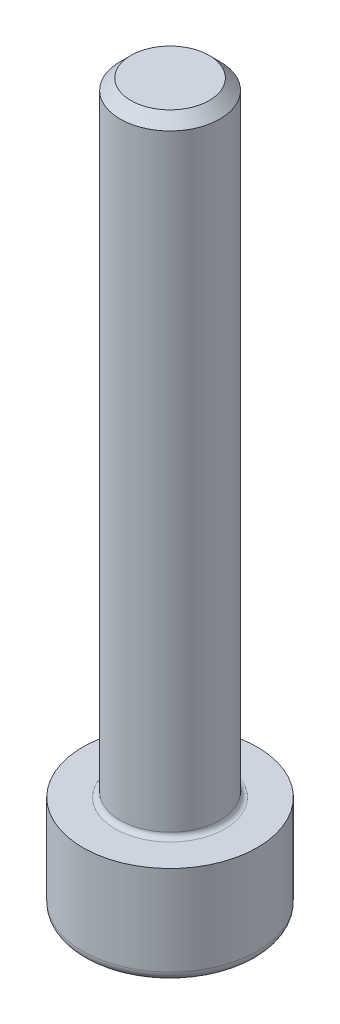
ISO-10303-21;
HEADER;
FILE_DESCRIPTION(('STEP AP214'),'2;1');
FILE_NAME('part.step','',(''),(''),'','','');
FILE_SCHEMA(('AUTOMOTIVE_DESIGN { 1 0 10303 214 1 1 1 1 }'));
ENDSEC;
DATA;
#1=APPLICATION_CONTEXT('core data for automotive mechanical design processes');
#2=APPLICATION_PROTOCOL_DEFINITION('international standard','automotive_design',2000,#1);
#3=PRODUCT_CONTEXT('',#1,'mechanical');
#4=PRODUCT('Part','Part','',(#3));
#5=PRODUCT_RELATED_PRODUCT_CATEGORY('part','',(#4));
#6=PRODUCT_DEFINITION_FORMATION('','',#4);
#7=PRODUCT_DEFINITION_CONTEXT('part definition',#1,'design');
#8=PRODUCT_DEFINITION('design','',#6,#7);
#9=PRODUCT_DEFINITION_SHAPE('','',#8);
#10=(LENGTH_UNIT() NAMED_UNIT(*) SI_UNIT(.MILLI.,.METRE.));
#11=(NAMED_UNIT(*) PLANE_ANGLE_UNIT() SI_UNIT($,.RADIAN.));
#12=(NAMED_UNIT(*) SI_UNIT($,.STERADIAN.) SOLID_ANGLE_UNIT());
#13=UNCERTAINTY_MEASURE_WITH_UNIT(LENGTH_MEASURE(1.E-05),#10,'distance_accuracy_value','');
#14=(GEOMETRIC_REPRESENTATION_CONTEXT(3) GLOBAL_UNCERTAINTY_ASSIGNED_CONTEXT((#13)) GLOBAL_UNIT_ASSIGNED_CONTEXT((#10,
#11,#12)) REPRESENTATION_CONTEXT('',''));
#15=CARTESIAN_POINT('',(0.,0.,0.));
#16=DIRECTION('',(0.,0.,1.));
#17=DIRECTION('',(1.,0.,0.));
#18=AXIS2_PLACEMENT_3D('',#15,#16,#17);
#19=CARTESIAN_POINT('',(0.,-4.,0.));
#20=DIRECTION('',(0.,-1.,0.));
#21=DIRECTION('',(1.,0.,0.));
#22=AXIS2_PLACEMENT_3D('',#19,#20,#21);
#23=PLANE('',#22);
#24=CARTESIAN_POINT('',(0.,-4.,0.));
#25=DIRECTION('',(0.,-1.,0.));
#26=DIRECTION('',(1.,0.,0.));
#27=AXIS2_PLACEMENT_3D('',#24,#25,#26);
#28=CIRCLE('',#27,3.1);
#29=CARTESIAN_POINT('',(3.1,-4.,0.));
#30=VERTEX_POINT('',#29);
#31=EDGE_CURVE('E26',#30,#30,#28,.T.);
#32=ORIENTED_EDGE('',*,*,#31,.T.);
#33=EDGE_LOOP('',(#32));
#34=FACE_BOUND('',#33,.T.);
#35=DIRECTION('',(-1.,0.,0.));
#36=VECTOR('',#35,1.);
#37=CARTESIAN_POINT('',(0.21650635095,-4.,-1.5));
#38=LINE('',#37,#36);
#39=CARTESIAN_POINT('',(0.8660254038,-4.,-1.5));
#40=VERTEX_POINT('',#39);
#41=CARTESIAN_POINT('',(-0.8660254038,-4.,-1.5));
#42=VERTEX_POINT('',#41);
#43=EDGE_CURVE('E99',#40,#42,#38,.T.);
#44=ORIENTED_EDGE('',*,*,#43,.T.);
#45=DIRECTION('',(-0.500000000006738,0.,0.866025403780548));
#46=VECTOR('',#45,1.);
#47=CARTESIAN_POINT('',(-1.29903810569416,-4.,-0.750000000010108));
#48=LINE('',#47,#46);
#49=CARTESIAN_POINT('',(-1.7320508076,-4.,0.));
#50=VERTEX_POINT('',#49);
#51=EDGE_CURVE('E67',#42,#50,#48,.T.);
#52=ORIENTED_EDGE('',*,*,#51,.T.);
#53=DIRECTION('',(0.500000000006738,0.,0.866025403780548));
#54=VECTOR('',#53,1.);
#55=CARTESIAN_POINT('',(-1.29903810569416,-4.,0.750000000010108));
#56=LINE('',#55,#54);
#57=CARTESIAN_POINT('',(-0.8660254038,-4.,1.5));
#58=VERTEX_POINT('',#57);
#59=EDGE_CURVE('E96',#50,#58,#56,.T.);
#60=ORIENTED_EDGE('',*,*,#59,.T.);
#61=DIRECTION('',(1.,0.,0.));
#62=VECTOR('',#61,1.);
#63=CARTESIAN_POINT('',(0.,-4.,1.5));
#64=LINE('',#63,#62);
#65=CARTESIAN_POINT('',(0.8660254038,-4.,1.5));
#66=VERTEX_POINT('',#65);
#67=EDGE_CURVE('E143',#58,#66,#64,.T.);
#68=ORIENTED_EDGE('',*,*,#67,.T.);
#69=DIRECTION('',(0.500000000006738,0.,-0.866025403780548));
#70=VECTOR('',#69,1.);
#71=CARTESIAN_POINT('',(1.29903810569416,-4.,0.750000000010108));
#72=LINE('',#71,#70);
#73=CARTESIAN_POINT('',(1.7320508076,-4.,0.));
#74=VERTEX_POINT('',#73);
#75=EDGE_CURVE('E122',#66,#74,#72,.T.);
#76=ORIENTED_EDGE('',*,*,#75,.T.);
#77=DIRECTION('',(-0.500000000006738,0.,-0.866025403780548));
#78=VECTOR('',#77,1.);
#79=CARTESIAN_POINT('',(1.29903810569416,-4.,-0.750000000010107));
#80=LINE('',#79,#78);
#81=EDGE_CURVE('E138',#74,#40,#80,.T.);
#82=ORIENTED_EDGE('',*,*,#81,.T.);
#83=EDGE_LOOP('',(#44,#52,#60,#68,#76,#82));
#84=FACE_BOUND('',#83,.T.);
#85=ADVANCED_FACE('F16',(#34,#84),#23,.T.);
#86=CARTESIAN_POINT('',(0.,0.,0.));
#87=DIRECTION('',(0.,1.,0.));
#88=DIRECTION('',(-1.,0.,0.));
#89=AXIS2_PLACEMENT_3D('',#86,#87,#88);
#90=PLANE('',#89);
#91=CARTESIAN_POINT('',(0.,0.,0.));
#92=DIRECTION('',(0.,1.,0.));
#93=DIRECTION('',(1.,0.,0.));
#94=AXIS2_PLACEMENT_3D('',#91,#92,#93);
#95=CIRCLE('',#94,3.5);
#96=CARTESIAN_POINT('',(3.5,0.,0.));
#97=VERTEX_POINT('',#96);
#98=EDGE_CURVE('E10',#97,#97,#95,.T.);
#99=ORIENTED_EDGE('',*,*,#98,.T.);
#100=EDGE_LOOP('',(#99));
#101=FACE_BOUND('',#100,.T.);
#102=CARTESIAN_POINT('',(0.,0.,0.));
#103=DIRECTION('',(0.,-1.,0.));
#104=DIRECTION('',(1.,0.,0.));
#105=AXIS2_PLACEMENT_3D('',#102,#103,#104);
#106=CIRCLE('',#105,2.2);
#107=CARTESIAN_POINT('',(2.2,0.,0.));
#108=VERTEX_POINT('',#107);
#109=EDGE_CURVE('E140',#108,#108,#106,.T.);
#110=ORIENTED_EDGE('',*,*,#109,.T.);
#111=EDGE_LOOP('',(#110));
#112=FACE_BOUND('',#111,.T.);
#113=ADVANCED_FACE('F179',(#101,#112),#90,.T.);
#114=CARTESIAN_POINT('',(0.,-2.,0.));
#115=DIRECTION('',(0.,1.,0.));
#116=DIRECTION('',(1.,0.,0.));
#117=AXIS2_PLACEMENT_3D('',#114,#115,#116);
#118=CYLINDRICAL_SURFACE('',#117,3.5);
#119=ORIENTED_EDGE('',*,*,#98,.F.);
#120=EDGE_LOOP('',(#119));
#121=FACE_BOUND('',#120,.T.);
#122=CARTESIAN_POINT('',(0.,-3.6,0.));
#123=DIRECTION('',(0.,1.,0.));
#124=DIRECTION('',(1.,0.,0.));
#125=AXIS2_PLACEMENT_3D('',#122,#123,#124);
#126=CIRCLE('',#125,3.5);
#127=CARTESIAN_POINT('',(3.5,-3.6,0.));
#128=VERTEX_POINT('',#127);
#129=EDGE_CURVE('E93',#128,#128,#126,.T.);
#130=ORIENTED_EDGE('',*,*,#129,.T.);
#131=EDGE_LOOP('',(#130));
#132=FACE_BOUND('',#131,.T.);
#133=ADVANCED_FACE('F185',(#121,#132),#118,.T.);
#134=CARTESIAN_POINT('',(0.,-3.6,0.));
#135=DIRECTION('',(0.,-1.,0.));
#136=DIRECTION('',(0.,0.,-1.));
#137=AXIS2_PLACEMENT_3D('',#134,#135,#136);
#138=TOROIDAL_SURFACE('',#137,3.1,0.4);
#139=ORIENTED_EDGE('',*,*,#31,.F.);
#140=EDGE_LOOP('',(#139));
#141=FACE_BOUND('',#140,.T.);
#142=ORIENTED_EDGE('',*,*,#129,.F.);
#143=EDGE_LOOP('',(#142));
#144=FACE_BOUND('',#143,.T.);
#145=ADVANCED_FACE('F18',(#141,#144),#138,.T.);
#146=CARTESIAN_POINT('',(0.,-2.,0.));
#147=DIRECTION('',(0.,1.,0.));
#148=DIRECTION('',(0.,0.,-1.));
#149=AXIS2_PLACEMENT_3D('',#146,#147,#148);
#150=PLANE('',#149);
#151=DIRECTION('',(1.,0.,0.));
#152=VECTOR('',#151,1.);
#153=CARTESIAN_POINT('',(0.,-2.,-1.5));
#154=LINE('',#153,#152);
#155=CARTESIAN_POINT('',(-0.8660254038,-2.,-1.5));
#156=VERTEX_POINT('',#155);
#157=CARTESIAN_POINT('',(0.8660254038,-2.,-1.5));
#158=VERTEX_POINT('',#157);
#159=EDGE_CURVE('E20',#156,#158,#154,.T.);
#160=ORIENTED_EDGE('',*,*,#159,.T.);
#161=DIRECTION('',(0.500000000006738,0.,0.866025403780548));
#162=VECTOR('',#161,1.);
#163=CARTESIAN_POINT('',(1.7320508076,-2.,0.));
#164=LINE('',#163,#162);
#165=CARTESIAN_POINT('',(1.7320508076,-2.,0.));
#166=VERTEX_POINT('',#165);
#167=EDGE_CURVE('E77',#158,#166,#164,.T.);
#168=ORIENTED_EDGE('',*,*,#167,.T.);
#169=DIRECTION('',(-0.500000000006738,0.,0.866025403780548));
#170=VECTOR('',#169,1.);
#171=CARTESIAN_POINT('',(0.8660254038,-2.,1.5));
#172=LINE('',#171,#170);
#173=CARTESIAN_POINT('',(0.8660254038,-2.,1.5));
#174=VERTEX_POINT('',#173);
#175=EDGE_CURVE('E120',#166,#174,#172,.T.);
#176=ORIENTED_EDGE('',*,*,#175,.T.);
#177=DIRECTION('',(-1.,0.,0.));
#178=VECTOR('',#177,1.);
#179=CARTESIAN_POINT('',(-0.866025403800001,-2.,1.5));
#180=LINE('',#179,#178);
#181=CARTESIAN_POINT('',(-0.866025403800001,-2.,1.5));
#182=VERTEX_POINT('',#181);
#183=EDGE_CURVE('E137',#174,#182,#180,.T.);
#184=ORIENTED_EDGE('',*,*,#183,.T.);
#185=DIRECTION('',(-0.500000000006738,0.,-0.866025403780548));
#186=VECTOR('',#185,1.);
#187=CARTESIAN_POINT('',(-1.7320508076,-2.,0.));
#188=LINE('',#187,#186);
#189=CARTESIAN_POINT('',(-1.7320508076,-2.,0.));
#190=VERTEX_POINT('',#189);
#191=EDGE_CURVE('E113',#182,#190,#188,.T.);
#192=ORIENTED_EDGE('',*,*,#191,.T.);
#193=DIRECTION('',(0.500000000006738,0.,-0.866025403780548));
#194=VECTOR('',#193,1.);
#195=CARTESIAN_POINT('',(-0.8660254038,-2.,-1.5));
#196=LINE('',#195,#194);
#197=EDGE_CURVE('E101',#190,#156,#196,.T.);
#198=ORIENTED_EDGE('',*,*,#197,.T.);
#199=EDGE_LOOP('',(#160,#168,#176,#184,#192,#198));
#200=FACE_BOUND('',#199,.T.);
#201=ADVANCED_FACE('F196',(#200),#150,.F.);
#202=CARTESIAN_POINT('',(-1.2990381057,-4.,-0.75));
#203=DIRECTION('',(-0.866025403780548,0.,-0.500000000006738));
#204=DIRECTION('',(-0.500000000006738,0.,0.866025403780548));
#205=AXIS2_PLACEMENT_3D('',#202,#203,#204);
#206=PLANE('',#205);
#207=ORIENTED_EDGE('',*,*,#197,.F.);
#208=DIRECTION('',(0.,1.,0.));
#209=VECTOR('',#208,1.);
#210=CARTESIAN_POINT('',(-1.7320508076,-4.,0.));
#211=LINE('',#210,#209);
#212=EDGE_CURVE('E104',#50,#190,#211,.T.);
#213=ORIENTED_EDGE('',*,*,#212,.F.);
#214=ORIENTED_EDGE('',*,*,#51,.F.);
#215=DIRECTION('',(0.,1.,0.));
#216=VECTOR('',#215,1.);
#217=CARTESIAN_POINT('',(-0.8660254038,-4.,-1.5));
#218=LINE('',#217,#216);
#219=EDGE_CURVE('E127',#42,#156,#218,.T.);
#220=ORIENTED_EDGE('',*,*,#219,.T.);
#221=EDGE_LOOP('',(#207,#213,#214,#220));
#222=FACE_BOUND('',#221,.T.);
#223=ADVANCED_FACE('F105',(#222),#206,.F.);
#224=CARTESIAN_POINT('',(-1.2990381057,-4.,0.75));
#225=DIRECTION('',(-0.866025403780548,0.,0.500000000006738));
#226=DIRECTION('',(0.500000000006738,0.,0.866025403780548));
#227=AXIS2_PLACEMENT_3D('',#224,#225,#226);
#228=PLANE('',#227);
#229=ORIENTED_EDGE('',*,*,#191,.F.);
#230=DIRECTION('',(0.,1.,0.));
#231=VECTOR('',#230,1.);
#232=CARTESIAN_POINT('',(-0.8660254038,-4.,1.5));
#233=LINE('',#232,#231);
#234=EDGE_CURVE('E111',#58,#182,#233,.T.);
#235=ORIENTED_EDGE('',*,*,#234,.F.);
#236=ORIENTED_EDGE('',*,*,#59,.F.);
#237=ORIENTED_EDGE('',*,*,#212,.T.);
#238=EDGE_LOOP('',(#229,#235,#236,#237));
#239=FACE_BOUND('',#238,.T.);
#240=ADVANCED_FACE('F109',(#239),#228,.F.);
#241=CARTESIAN_POINT('',(0.,-4.,1.5));
#242=DIRECTION('',(0.,0.,1.));
#243=DIRECTION('',(1.,0.,0.));
#244=AXIS2_PLACEMENT_3D('',#241,#242,#243);
#245=PLANE('',#244);
#246=ORIENTED_EDGE('',*,*,#183,.F.);
#247=DIRECTION('',(0.,1.,0.));
#248=VECTOR('',#247,1.);
#249=CARTESIAN_POINT('',(0.8660254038,-4.,1.5));
#250=LINE('',#249,#248);
#251=EDGE_CURVE('E134',#66,#174,#250,.T.);
#252=ORIENTED_EDGE('',*,*,#251,.F.);
#253=ORIENTED_EDGE('',*,*,#67,.F.);
#254=ORIENTED_EDGE('',*,*,#234,.T.);
#255=EDGE_LOOP('',(#246,#252,#253,#254));
#256=FACE_BOUND('',#255,.T.);
#257=ADVANCED_FACE('F245',(#256),#245,.F.);
#258=CARTESIAN_POINT('',(1.2990381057,-4.,0.75));
#259=DIRECTION('',(0.866025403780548,0.,0.500000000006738));
#260=DIRECTION('',(0.500000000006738,0.,-0.866025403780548));
#261=AXIS2_PLACEMENT_3D('',#258,#259,#260);
#262=PLANE('',#261);
#263=ORIENTED_EDGE('',*,*,#175,.F.);
#264=DIRECTION('',(0.,1.,0.));
#265=VECTOR('',#264,1.);
#266=CARTESIAN_POINT('',(1.7320508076,-4.,0.));
#267=LINE('',#266,#265);
#268=EDGE_CURVE('E123',#74,#166,#267,.T.);
#269=ORIENTED_EDGE('',*,*,#268,.F.);
#270=ORIENTED_EDGE('',*,*,#75,.F.);
#271=ORIENTED_EDGE('',*,*,#251,.T.);
#272=EDGE_LOOP('',(#263,#269,#270,#271));
#273=FACE_BOUND('',#272,.T.);
#274=ADVANCED_FACE('F189',(#273),#262,.F.);
#275=CARTESIAN_POINT('',(1.2990381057,-4.,-0.75));
#276=DIRECTION('',(0.866025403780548,0.,-0.500000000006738));
#277=DIRECTION('',(-0.500000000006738,0.,-0.866025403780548));
#278=AXIS2_PLACEMENT_3D('',#275,#276,#277);
#279=PLANE('',#278);
#280=ORIENTED_EDGE('',*,*,#167,.F.);
#281=DIRECTION('',(0.,1.,0.));
#282=VECTOR('',#281,1.);
#283=CARTESIAN_POINT('',(0.8660254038,-4.,-1.5));
#284=LINE('',#283,#282);
#285=EDGE_CURVE('E118',#40,#158,#284,.T.);
#286=ORIENTED_EDGE('',*,*,#285,.F.);
#287=ORIENTED_EDGE('',*,*,#81,.F.);
#288=ORIENTED_EDGE('',*,*,#268,.T.);
#289=EDGE_LOOP('',(#280,#286,#287,#288));
#290=FACE_BOUND('',#289,.T.);
#291=ADVANCED_FACE('F172',(#290),#279,.F.);
#292=CARTESIAN_POINT('',(0.4330127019,-4.,-1.5));
#293=DIRECTION('',(0.,0.,-1.));
#294=DIRECTION('',(-1.,0.,0.));
#295=AXIS2_PLACEMENT_3D('',#292,#293,#294);
#296=PLANE('',#295);
#297=ORIENTED_EDGE('',*,*,#159,.F.);
#298=ORIENTED_EDGE('',*,*,#219,.F.);
#299=ORIENTED_EDGE('',*,*,#43,.F.);
#300=ORIENTED_EDGE('',*,*,#285,.T.);
#301=EDGE_LOOP('',(#297,#298,#299,#300));
#302=FACE_BOUND('',#301,.T.);
#303=ADVANCED_FACE('F162',(#302),#296,.F.);
#304=CARTESIAN_POINT('',(0.,0.2,0.));
#305=DIRECTION('',(0.,1.,0.));
#306=DIRECTION('',(1.,0.,0.));
#307=AXIS2_PLACEMENT_3D('',#304,#305,#306);
#308=TOROIDAL_SURFACE('',#307,2.2,0.2);
#309=ORIENTED_EDGE('',*,*,#109,.F.);
#310=EDGE_LOOP('',(#309));
#311=FACE_BOUND('',#310,.T.);
#312=CARTESIAN_POINT('',(0.,0.2,0.));
#313=DIRECTION('',(0.,1.,0.));
#314=DIRECTION('',(0.,0.,1.));
#315=AXIS2_PLACEMENT_3D('',#312,#313,#314);
#316=CIRCLE('',#315,2.);
#317=CARTESIAN_POINT('',(0.,0.2,-2.));
#318=VERTEX_POINT('',#317);
#319=EDGE_CURVE('E132',#318,#318,#316,.T.);
#320=ORIENTED_EDGE('',*,*,#319,.F.);
#321=EDGE_LOOP('',(#320));
#322=FACE_BOUND('',#321,.T.);
#323=ADVANCED_FACE('F159',(#311,#322),#308,.F.);
#324=CARTESIAN_POINT('',(0.,25.,0.));
#325=DIRECTION('',(0.,1.,0.));
#326=DIRECTION('',(1.,0.,0.));
#327=AXIS2_PLACEMENT_3D('',#324,#325,#326);
#328=PLANE('',#327);
#329=CARTESIAN_POINT('',(0.,25.,0.));
#330=DIRECTION('',(0.,1.,0.));
#331=DIRECTION('',(1.,0.,0.));
#332=AXIS2_PLACEMENT_3D('',#329,#330,#331);
#333=CIRCLE('',#332,1.5706);
#334=CARTESIAN_POINT('',(1.5706,25.,0.));
#335=VERTEX_POINT('',#334);
#336=EDGE_CURVE('E133',#335,#335,#333,.T.);
#337=ORIENTED_EDGE('',*,*,#336,.T.);
#338=EDGE_LOOP('',(#337));
#339=FACE_BOUND('',#338,.T.);
#340=ADVANCED_FACE('F161',(#339),#328,.T.);
#341=CARTESIAN_POINT('',(0.,12.5,0.));
#342=DIRECTION('',(0.,-1.,0.));
#343=DIRECTION('',(1.,0.,0.));
#344=AXIS2_PLACEMENT_3D('',#341,#342,#343);
#345=CYLINDRICAL_SURFACE('',#344,2.);
#346=ORIENTED_EDGE('',*,*,#319,.T.);
#347=EDGE_LOOP('',(#346));
#348=FACE_BOUND('',#347,.T.);
#349=CARTESIAN_POINT('',(0.,24.5706,0.));
#350=DIRECTION('',(0.,-1.,0.));
#351=DIRECTION('',(1.,0.,0.));
#352=AXIS2_PLACEMENT_3D('',#349,#350,#351);
#353=CIRCLE('',#352,2.);
#354=CARTESIAN_POINT('',(2.,24.5706,0.));
#355=VERTEX_POINT('',#354);
#356=EDGE_CURVE('E130',#355,#355,#353,.T.);
#357=ORIENTED_EDGE('',*,*,#356,.T.);
#358=EDGE_LOOP('',(#357));
#359=FACE_BOUND('',#358,.T.);
#360=ADVANCED_FACE('F156',(#348,#359),#345,.T.);
#361=CARTESIAN_POINT('',(0.,24.7853,0.));
#362=DIRECTION('',(0.,-1.,0.));
#363=DIRECTION('',(1.,0.,0.));
#364=AXIS2_PLACEMENT_3D('',#361,#362,#363);
#365=CONICAL_SURFACE('',#364,1.7853,0.785398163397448);
#366=ORIENTED_EDGE('',*,*,#356,.F.);
#367=EDGE_LOOP('',(#366));
#368=FACE_BOUND('',#367,.T.);
#369=ORIENTED_EDGE('',*,*,#336,.F.);
#370=EDGE_LOOP('',(#369));
#371=FACE_BOUND('',#370,.T.);
#372=ADVANCED_FACE('F191',(#368,#371),#365,.T.);
#373=CLOSED_SHELL('',(#85,#113,#133,#145,#201,#223,#240,#257,#274,#291,#303,#323,#340,#360,#372));
#374=MANIFOLD_SOLID_BREP('B1',#373);
#375=ADVANCED_BREP_SHAPE_REPRESENTATION('',(#18,#374),#14);
#376=SHAPE_DEFINITION_REPRESENTATION(#9,#375);
ENDSEC;
END-ISO-10303-21;
